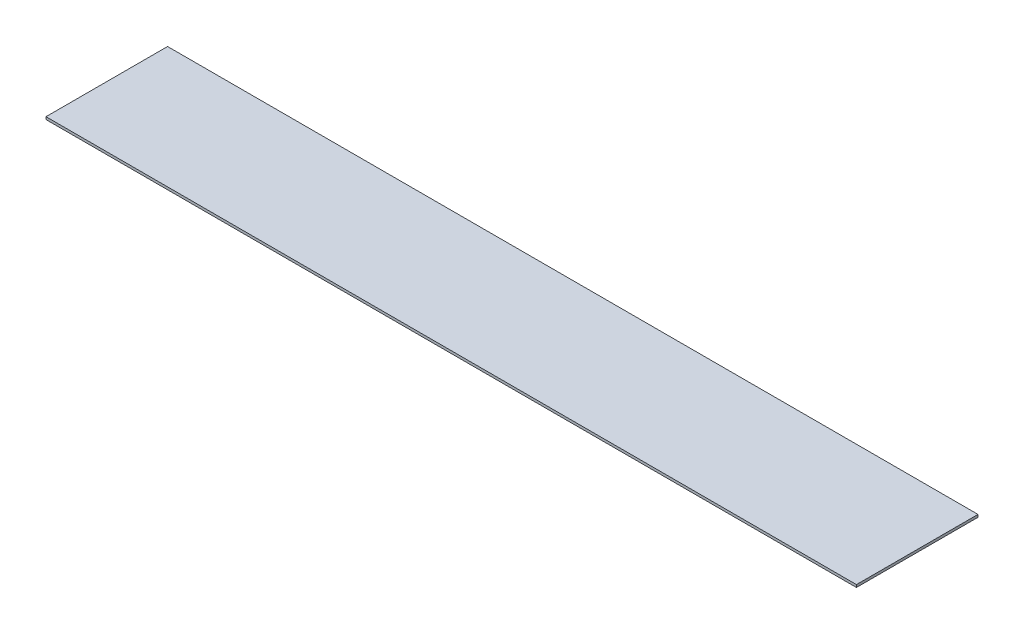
ISO-10303-21;
HEADER;
FILE_DESCRIPTION(('STEP AP214'),'2;1');
FILE_NAME('part.step','',(''),(''),'','','');
FILE_SCHEMA(('AUTOMOTIVE_DESIGN { 1 0 10303 214 1 1 1 1 }'));
ENDSEC;
DATA;
#1=APPLICATION_CONTEXT('core data for automotive mechanical design processes');
#2=APPLICATION_PROTOCOL_DEFINITION('international standard','automotive_design',2000,#1);
#3=PRODUCT_CONTEXT('',#1,'mechanical');
#4=PRODUCT('Part','Part','',(#3));
#5=PRODUCT_RELATED_PRODUCT_CATEGORY('part','',(#4));
#6=PRODUCT_DEFINITION_FORMATION('','',#4);
#7=PRODUCT_DEFINITION_CONTEXT('part definition',#1,'design');
#8=PRODUCT_DEFINITION('design','',#6,#7);
#9=PRODUCT_DEFINITION_SHAPE('','',#8);
#10=(LENGTH_UNIT() NAMED_UNIT(*) SI_UNIT(.MILLI.,.METRE.));
#11=(NAMED_UNIT(*) PLANE_ANGLE_UNIT() SI_UNIT($,.RADIAN.));
#12=(NAMED_UNIT(*) SI_UNIT($,.STERADIAN.) SOLID_ANGLE_UNIT());
#13=UNCERTAINTY_MEASURE_WITH_UNIT(LENGTH_MEASURE(1.E-05),#10,'distance_accuracy_value','');
#14=(GEOMETRIC_REPRESENTATION_CONTEXT(3) GLOBAL_UNCERTAINTY_ASSIGNED_CONTEXT((#13)) GLOBAL_UNIT_ASSIGNED_CONTEXT((#10,
#11,#12)) REPRESENTATION_CONTEXT('',''));
#15=CARTESIAN_POINT('',(0.,0.,0.));
#16=DIRECTION('',(0.,0.,1.));
#17=DIRECTION('',(1.,0.,0.));
#18=AXIS2_PLACEMENT_3D('',#15,#16,#17);
#19=CARTESIAN_POINT('',(1016.,3.175,152.4));
#20=DIRECTION('',(-1.,0.,0.));
#21=DIRECTION('',(0.,0.,1.));
#22=AXIS2_PLACEMENT_3D('',#19,#20,#21);
#23=PLANE('',#22);
#24=DIRECTION('',(0.,0.,-1.));
#25=VECTOR('',#24,1.);
#26=CARTESIAN_POINT('',(1016.,-3.175,152.4));
#27=LINE('',#26,#25);
#28=CARTESIAN_POINT('',(1016.,-3.175,152.4));
#29=VERTEX_POINT('',#28);
#30=CARTESIAN_POINT('',(1016.,-3.175,-152.4));
#31=VERTEX_POINT('',#30);
#32=EDGE_CURVE('E93',#29,#31,#27,.T.);
#33=ORIENTED_EDGE('',*,*,#32,.T.);
#34=DIRECTION('',(0.,-1.,0.));
#35=VECTOR('',#34,1.);
#36=CARTESIAN_POINT('',(1016.,3.175,-152.4));
#37=LINE('',#36,#35);
#38=CARTESIAN_POINT('',(1016.,3.175,-152.4));
#39=VERTEX_POINT('',#38);
#40=EDGE_CURVE('E11',#39,#31,#37,.T.);
#41=ORIENTED_EDGE('',*,*,#40,.F.);
#42=DIRECTION('',(0.,0.,-1.));
#43=VECTOR('',#42,1.);
#44=CARTESIAN_POINT('',(1016.,3.175,152.4));
#45=LINE('',#44,#43);
#46=CARTESIAN_POINT('',(1016.,3.175,152.4));
#47=VERTEX_POINT('',#46);
#48=EDGE_CURVE('E81',#47,#39,#45,.T.);
#49=ORIENTED_EDGE('',*,*,#48,.F.);
#50=DIRECTION('',(0.,-1.,0.));
#51=VECTOR('',#50,1.);
#52=CARTESIAN_POINT('',(1016.,3.175,152.4));
#53=LINE('',#52,#51);
#54=EDGE_CURVE('E89',#47,#29,#53,.T.);
#55=ORIENTED_EDGE('',*,*,#54,.T.);
#56=EDGE_LOOP('',(#33,#41,#49,#55));
#57=FACE_BOUND('',#56,.T.);
#58=ADVANCED_FACE('F30',(#57),#23,.F.);
#59=CARTESIAN_POINT('',(-1016.,3.175,-152.4));
#60=DIRECTION('',(0.,0.,1.));
#61=DIRECTION('',(1.,0.,0.));
#62=AXIS2_PLACEMENT_3D('',#59,#60,#61);
#63=PLANE('',#62);
#64=DIRECTION('',(-1.,0.,0.));
#65=VECTOR('',#64,1.);
#66=CARTESIAN_POINT('',(-1016.,-3.175,-152.4));
#67=LINE('',#66,#65);
#68=CARTESIAN_POINT('',(-1016.,-3.175,-152.4));
#69=VERTEX_POINT('',#68);
#70=EDGE_CURVE('E85',#31,#69,#67,.T.);
#71=ORIENTED_EDGE('',*,*,#70,.T.);
#72=DIRECTION('',(0.,-1.,0.));
#73=VECTOR('',#72,1.);
#74=CARTESIAN_POINT('',(-1016.,3.175,-152.4));
#75=LINE('',#74,#73);
#76=CARTESIAN_POINT('',(-1016.,3.175,-152.4));
#77=VERTEX_POINT('',#76);
#78=EDGE_CURVE('E38',#77,#69,#75,.T.);
#79=ORIENTED_EDGE('',*,*,#78,.F.);
#80=DIRECTION('',(-1.,0.,0.));
#81=VECTOR('',#80,1.);
#82=CARTESIAN_POINT('',(-1016.,3.175,-152.4));
#83=LINE('',#82,#81);
#84=EDGE_CURVE('E76',#39,#77,#83,.T.);
#85=ORIENTED_EDGE('',*,*,#84,.F.);
#86=ORIENTED_EDGE('',*,*,#40,.T.);
#87=EDGE_LOOP('',(#71,#79,#85,#86));
#88=FACE_BOUND('',#87,.T.);
#89=ADVANCED_FACE('F84',(#88),#63,.F.);
#90=CARTESIAN_POINT('',(-1016.,3.175,152.4));
#91=DIRECTION('',(1.,0.,0.));
#92=DIRECTION('',(0.,0.,-1.));
#93=AXIS2_PLACEMENT_3D('',#90,#91,#92);
#94=PLANE('',#93);
#95=DIRECTION('',(0.,0.,1.));
#96=VECTOR('',#95,1.);
#97=CARTESIAN_POINT('',(-1016.,-3.175,152.4));
#98=LINE('',#97,#96);
#99=CARTESIAN_POINT('',(-1016.,-3.175,152.4));
#100=VERTEX_POINT('',#99);
#101=EDGE_CURVE('E63',#69,#100,#98,.T.);
#102=ORIENTED_EDGE('',*,*,#101,.T.);
#103=DIRECTION('',(0.,-1.,0.));
#104=VECTOR('',#103,1.);
#105=CARTESIAN_POINT('',(-1016.,3.175,152.4));
#106=LINE('',#105,#104);
#107=CARTESIAN_POINT('',(-1016.,3.175,152.4));
#108=VERTEX_POINT('',#107);
#109=EDGE_CURVE('E86',#108,#100,#106,.T.);
#110=ORIENTED_EDGE('',*,*,#109,.F.);
#111=DIRECTION('',(0.,0.,1.));
#112=VECTOR('',#111,1.);
#113=CARTESIAN_POINT('',(-1016.,3.175,152.4));
#114=LINE('',#113,#112);
#115=EDGE_CURVE('E79',#77,#108,#114,.T.);
#116=ORIENTED_EDGE('',*,*,#115,.F.);
#117=ORIENTED_EDGE('',*,*,#78,.T.);
#118=EDGE_LOOP('',(#102,#110,#116,#117));
#119=FACE_BOUND('',#118,.T.);
#120=ADVANCED_FACE('F87',(#119),#94,.F.);
#121=CARTESIAN_POINT('',(-1016.,3.175,152.4));
#122=DIRECTION('',(0.,0.,-1.));
#123=DIRECTION('',(-1.,0.,0.));
#124=AXIS2_PLACEMENT_3D('',#121,#122,#123);
#125=PLANE('',#124);
#126=DIRECTION('',(1.,0.,0.));
#127=VECTOR('',#126,1.);
#128=CARTESIAN_POINT('',(-1016.,-3.175,152.4));
#129=LINE('',#128,#127);
#130=EDGE_CURVE('E69',#100,#29,#129,.T.);
#131=ORIENTED_EDGE('',*,*,#130,.T.);
#132=ORIENTED_EDGE('',*,*,#54,.F.);
#133=DIRECTION('',(1.,0.,0.));
#134=VECTOR('',#133,1.);
#135=CARTESIAN_POINT('',(-1016.,3.175,152.4));
#136=LINE('',#135,#134);
#137=EDGE_CURVE('E46',#108,#47,#136,.T.);
#138=ORIENTED_EDGE('',*,*,#137,.F.);
#139=ORIENTED_EDGE('',*,*,#109,.T.);
#140=EDGE_LOOP('',(#131,#132,#138,#139));
#141=FACE_BOUND('',#140,.T.);
#142=ADVANCED_FACE('F100',(#141),#125,.F.);
#143=CARTESIAN_POINT('',(1016.,3.175,-152.4));
#144=DIRECTION('',(0.,-1.,0.));
#145=DIRECTION('',(0.,0.,-1.));
#146=AXIS2_PLACEMENT_3D('',#143,#144,#145);
#147=PLANE('',#146);
#148=ORIENTED_EDGE('',*,*,#48,.T.);
#149=ORIENTED_EDGE('',*,*,#84,.T.);
#150=ORIENTED_EDGE('',*,*,#115,.T.);
#151=ORIENTED_EDGE('',*,*,#137,.T.);
#152=EDGE_LOOP('',(#148,#149,#150,#151));
#153=FACE_BOUND('',#152,.T.);
#154=ADVANCED_FACE('F77',(#153),#147,.F.);
#155=CARTESIAN_POINT('',(1016.,-3.175,-152.4));
#156=DIRECTION('',(0.,-1.,0.));
#157=DIRECTION('',(0.,0.,-1.));
#158=AXIS2_PLACEMENT_3D('',#155,#156,#157);
#159=PLANE('',#158);
#160=ORIENTED_EDGE('',*,*,#32,.F.);
#161=ORIENTED_EDGE('',*,*,#130,.F.);
#162=ORIENTED_EDGE('',*,*,#101,.F.);
#163=ORIENTED_EDGE('',*,*,#70,.F.);
#164=EDGE_LOOP('',(#160,#161,#162,#163));
#165=FACE_BOUND('',#164,.T.);
#166=ADVANCED_FACE('F103',(#165),#159,.T.);
#167=CLOSED_SHELL('',(#58,#89,#120,#142,#154,#166));
#168=MANIFOLD_SOLID_BREP('B2',#167);
#169=ADVANCED_BREP_SHAPE_REPRESENTATION('',(#18,#168),#14);
#170=SHAPE_DEFINITION_REPRESENTATION(#9,#169);
ENDSEC;
END-ISO-10303-21;
